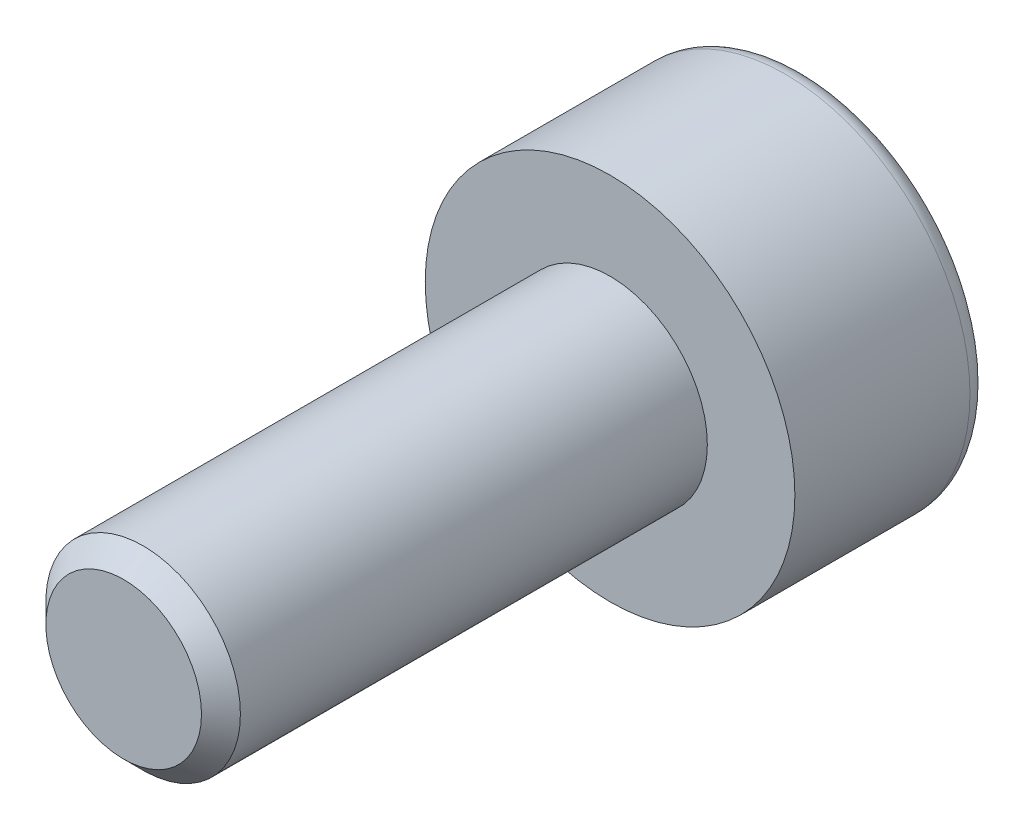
from build123d import *

# Parameters (mm, degrees)
ENLEV_MAT_EXTRU1_DEPTH = 1
ESQUISSE3_W            = 1
ESQUISSE3_H            = 5
CHANFREIN1_SIZE        = 0.2


with BuildPart() as part:
    # Esquisse1 → Base-R_volution (revolve)
    with BuildSketch(Plane(origin=(0, 0, 0), x_dir=(1, 0, 0), z_dir=(0, 1, 0)), mode=Mode.PRIVATE) as base_r_volution_sk:
        with BuildLine():
            Line((0, 0), (1.9, 0))
            Line((1.9, 0), (1.9, 1.8))
            ThreePointArc((1.9, 1.8), (1.841421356, 1.941421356), (1.7, 2))
            Line((1.7, 2), (0, 2))
            Line((0, 2), (0, 0))
        make_face()
    revolve(base_r_volution_sk.sketch.rotate(Axis((0, 0, 0), (0, 0, -1)), 180), axis=Axis((0, 0, 0), (0, 0, -1)))

    # Esquisse2 → enlev-mat-Extru1 (cut)
    with BuildSketch(Plane.XY.offset(-2)):
        Polygon((0.75, -0.433012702), (0.75, 0.433012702), (0, 0.866025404), (-0.75, 0.433012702), (-0.75, -0.433012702), (0, -0.866025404), align=None)
    extrude(amount=ENLEV_MAT_EXTRU1_DEPTH, mode=Mode.SUBTRACT)

    # Esquisse3 → Boss.-R_vol.1 (revolve)
    with BuildSketch(Plane(origin=(0, 0, 0), x_dir=(1, 0, 0), z_dir=(0, 1, 0))):
        with Locations((0.5, -2.5)):
            Rectangle(ESQUISSE3_W, ESQUISSE3_H)
    revolve(axis=Axis((0, 0, 0), (0, 0, 1)))

    # Chanfrein1
    chanfrein1_edges = [part.edges().sort_by_distance(p)[0] for p in [
        (-1, 0, 5),
    ]]
    chamfer(chanfrein1_edges, length=CHANFREIN1_SIZE)


solid = part.part
